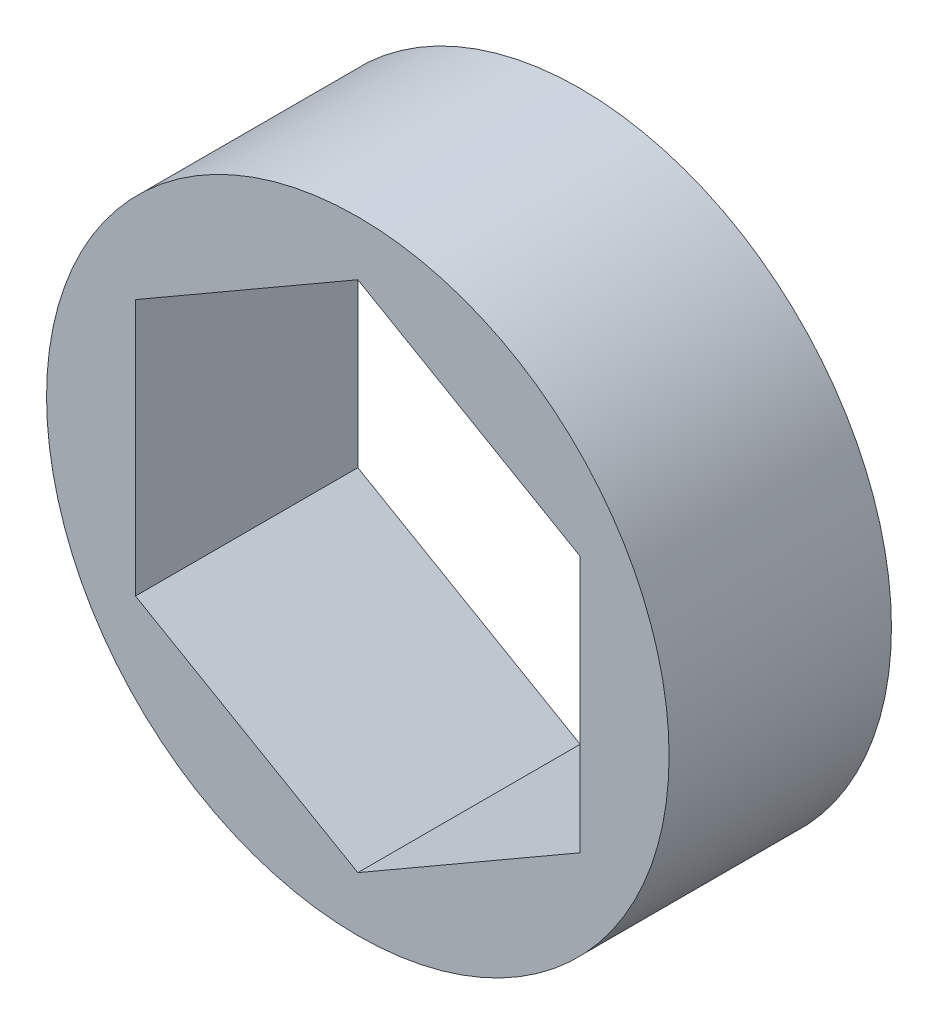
from build123d import *

# Parameters (mm, degrees)
SKETCH1_R           = 8.89
BOSS_EXTRUDE1_DEPTH = 6.35


with BuildPart() as part:
    # Sketch1 → Boss-Extrude1 (new body)
    with BuildSketch(Plane.XY):
        Circle(SKETCH1_R)
        Polygon((0, 7.332348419), (-6.35, 3.666174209), (-6.35, -3.666174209), (0, -7.332348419), (6.35, -3.666174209), (6.35, 3.666174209), align=None, mode=Mode.SUBTRACT)
    extrude(amount=BOSS_EXTRUDE1_DEPTH)


solid = part.part
